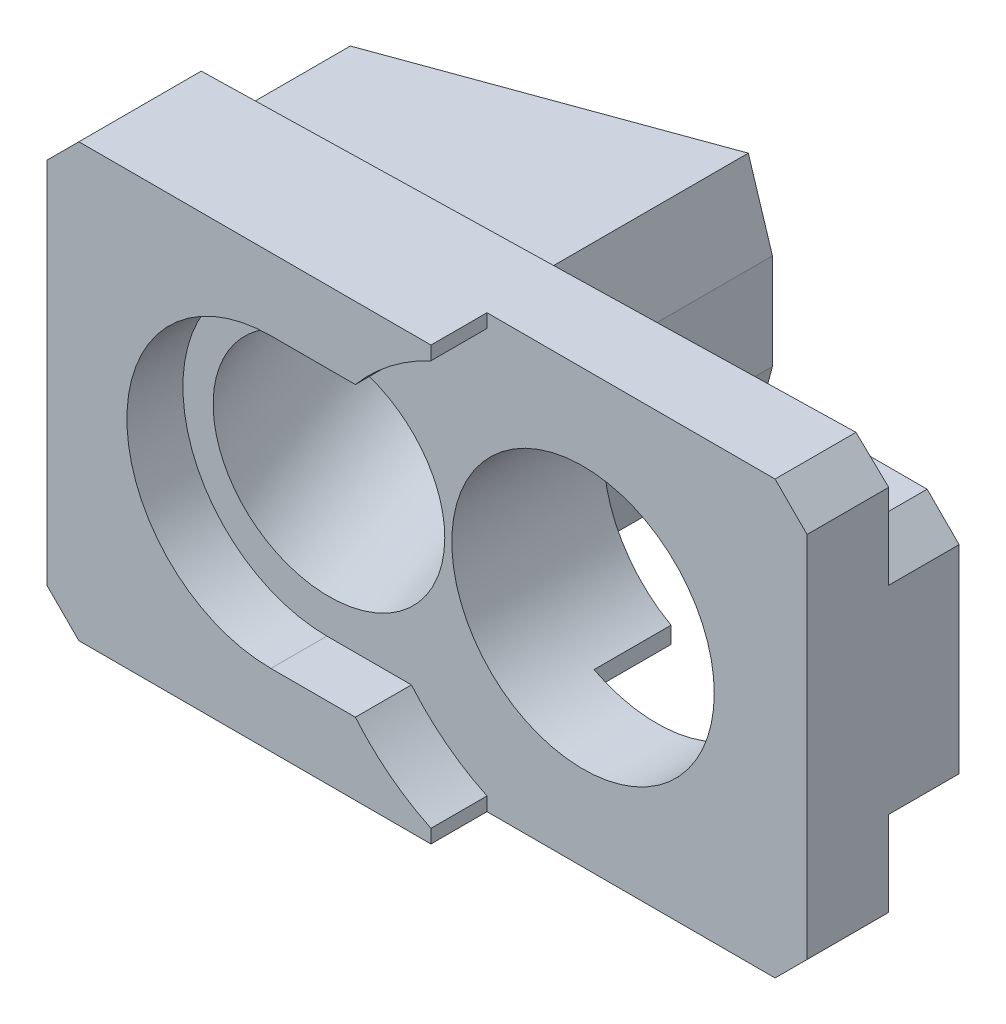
ISO-10303-21;
HEADER;
FILE_DESCRIPTION(('STEP AP214'),'2;1');
FILE_NAME('part.step','',(''),(''),'','','');
FILE_SCHEMA(('AUTOMOTIVE_DESIGN { 1 0 10303 214 1 1 1 1 }'));
ENDSEC;
DATA;
#1=APPLICATION_CONTEXT('core data for automotive mechanical design processes');
#2=APPLICATION_PROTOCOL_DEFINITION('international standard','automotive_design',2000,#1);
#3=PRODUCT_CONTEXT('',#1,'mechanical');
#4=PRODUCT('Part','Part','',(#3));
#5=PRODUCT_RELATED_PRODUCT_CATEGORY('part','',(#4));
#6=PRODUCT_DEFINITION_FORMATION('','',#4);
#7=PRODUCT_DEFINITION_CONTEXT('part definition',#1,'design');
#8=PRODUCT_DEFINITION('design','',#6,#7);
#9=PRODUCT_DEFINITION_SHAPE('','',#8);
#10=(LENGTH_UNIT() NAMED_UNIT(*) SI_UNIT(.MILLI.,.METRE.));
#11=(NAMED_UNIT(*) PLANE_ANGLE_UNIT() SI_UNIT($,.RADIAN.));
#12=(NAMED_UNIT(*) SI_UNIT($,.STERADIAN.) SOLID_ANGLE_UNIT());
#13=UNCERTAINTY_MEASURE_WITH_UNIT(LENGTH_MEASURE(1.E-05),#10,'distance_accuracy_value','');
#14=(GEOMETRIC_REPRESENTATION_CONTEXT(3) GLOBAL_UNCERTAINTY_ASSIGNED_CONTEXT((#13)) GLOBAL_UNIT_ASSIGNED_CONTEXT((#10,
#11,#12)) REPRESENTATION_CONTEXT('',''));
#15=CARTESIAN_POINT('',(0.,0.,0.));
#16=DIRECTION('',(0.,0.,1.));
#17=DIRECTION('',(1.,0.,0.));
#18=AXIS2_PLACEMENT_3D('',#15,#16,#17);
#19=CARTESIAN_POINT('',(2.,-4.1,4.75));
#20=DIRECTION('',(0.,-1.,0.));
#21=DIRECTION('',(0.,0.,-1.));
#22=AXIS2_PLACEMENT_3D('',#19,#20,#21);
#23=PLANE('',#22);
#24=DIRECTION('',(-1.,0.,0.));
#25=VECTOR('',#24,1.);
#26=CARTESIAN_POINT('',(4.36748497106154,-4.1,0.));
#27=LINE('',#26,#25);
#28=CARTESIAN_POINT('',(6.,-4.1,0.));
#29=VERTEX_POINT('',#28);
#30=CARTESIAN_POINT('',(2.,-4.1,0.));
#31=VERTEX_POINT('',#30);
#32=EDGE_CURVE('E298',#29,#31,#27,.T.);
#33=ORIENTED_EDGE('',*,*,#32,.F.);
#34=DIRECTION('',(0.,0.,1.));
#35=VECTOR('',#34,1.);
#36=CARTESIAN_POINT('',(6.,-4.1,4.75));
#37=LINE('',#36,#35);
#38=CARTESIAN_POINT('',(6.,-4.1,2.22272727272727));
#39=VERTEX_POINT('',#38);
#40=EDGE_CURVE('E252',#39,#29,#37,.F.);
#41=ORIENTED_EDGE('',*,*,#40,.F.);
#42=DIRECTION('',(0.999741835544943,0.,-0.022721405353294));
#43=VECTOR('',#42,1.);
#44=CARTESIAN_POINT('',(7.,-4.1,2.2));
#45=LINE('',#44,#43);
#46=CARTESIAN_POINT('',(2.,-4.1,2.31363636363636));
#47=VERTEX_POINT('',#46);
#48=EDGE_CURVE('E295',#39,#47,#45,.F.);
#49=ORIENTED_EDGE('',*,*,#48,.T.);
#50=DIRECTION('',(0.,0.,1.));
#51=VECTOR('',#50,1.);
#52=CARTESIAN_POINT('',(2.,-4.1,4.75));
#53=LINE('',#52,#51);
#54=EDGE_CURVE('E291',#31,#47,#53,.T.);
#55=ORIENTED_EDGE('',*,*,#54,.F.);
#56=EDGE_LOOP('',(#33,#41,#49,#55));
#57=FACE_BOUND('',#56,.T.);
#58=ADVANCED_FACE('F16',(#57),#23,.T.);
#59=CARTESIAN_POINT('',(6.,4.1,4.75));
#60=DIRECTION('',(0.,1.,0.));
#61=DIRECTION('',(0.,0.,1.));
#62=AXIS2_PLACEMENT_3D('',#59,#60,#61);
#63=PLANE('',#62);
#64=DIRECTION('',(-1.,0.,0.));
#65=VECTOR('',#64,1.);
#66=CARTESIAN_POINT('',(4.36748497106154,4.1,0.));
#67=LINE('',#66,#65);
#68=CARTESIAN_POINT('',(2.,4.1,0.));
#69=VERTEX_POINT('',#68);
#70=CARTESIAN_POINT('',(6.,4.1,0.));
#71=VERTEX_POINT('',#70);
#72=EDGE_CURVE('E283',#69,#71,#67,.F.);
#73=ORIENTED_EDGE('',*,*,#72,.F.);
#74=DIRECTION('',(0.,0.,1.));
#75=VECTOR('',#74,1.);
#76=CARTESIAN_POINT('',(2.,4.1,4.75));
#77=LINE('',#76,#75);
#78=CARTESIAN_POINT('',(2.,4.1,2.31363636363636));
#79=VERTEX_POINT('',#78);
#80=EDGE_CURVE('E268',#79,#69,#77,.F.);
#81=ORIENTED_EDGE('',*,*,#80,.F.);
#82=DIRECTION('',(0.999741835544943,0.,-0.022721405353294));
#83=VECTOR('',#82,1.);
#84=CARTESIAN_POINT('',(7.,4.10000000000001,2.2));
#85=LINE('',#84,#83);
#86=CARTESIAN_POINT('',(6.,4.1,2.22272727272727));
#87=VERTEX_POINT('',#86);
#88=EDGE_CURVE('E275',#79,#87,#85,.T.);
#89=ORIENTED_EDGE('',*,*,#88,.T.);
#90=DIRECTION('',(0.,0.,1.));
#91=VECTOR('',#90,1.);
#92=CARTESIAN_POINT('',(6.,4.1,4.75));
#93=LINE('',#92,#91);
#94=EDGE_CURVE('E310',#71,#87,#93,.T.);
#95=ORIENTED_EDGE('',*,*,#94,.F.);
#96=EDGE_LOOP('',(#73,#81,#89,#95));
#97=FACE_BOUND('',#96,.T.);
#98=ADVANCED_FACE('F882',(#97),#63,.T.);
#99=CARTESIAN_POINT('',(-2.,4.1,4.75));
#100=DIRECTION('',(0.,1.,0.));
#101=DIRECTION('',(0.,0.,1.));
#102=AXIS2_PLACEMENT_3D('',#99,#100,#101);
#103=PLANE('',#102);
#104=DIRECTION('',(-1.,0.,0.));
#105=VECTOR('',#104,1.);
#106=CARTESIAN_POINT('',(-8.5,4.1,0.));
#107=LINE('',#106,#105);
#108=CARTESIAN_POINT('',(-5.88538576,4.1,0.));
#109=VERTEX_POINT('',#108);
#110=CARTESIAN_POINT('',(-2.,4.1,0.));
#111=VERTEX_POINT('',#110);
#112=EDGE_CURVE('E232',#109,#111,#107,.F.);
#113=ORIENTED_EDGE('',*,*,#112,.F.);
#114=DIRECTION('',(0.,0.,1.));
#115=VECTOR('',#114,1.);
#116=CARTESIAN_POINT('',(-5.88538576,4.1,0.));
#117=LINE('',#116,#115);
#118=CARTESIAN_POINT('',(-5.88538576,4.1,-6.29865684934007));
#119=VERTEX_POINT('',#118);
#120=EDGE_CURVE('E205',#119,#109,#117,.T.);
#121=ORIENTED_EDGE('',*,*,#120,.F.);
#122=DIRECTION('',(-0.939692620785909,0.,0.342020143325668));
#123=VECTOR('',#122,1.);
#124=CARTESIAN_POINT('',(-10.9703557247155,4.1,-4.44787914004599));
#125=LINE('',#124,#123);
#126=CARTESIAN_POINT('',(-15.,4.1,-2.98120856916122));
#127=VERTEX_POINT('',#126);
#128=EDGE_CURVE('E188',#127,#119,#125,.F.);
#129=ORIENTED_EDGE('',*,*,#128,.F.);
#130=DIRECTION('',(0.,0.,1.));
#131=VECTOR('',#130,1.);
#132=CARTESIAN_POINT('',(-15.,4.1,6.5));
#133=LINE('',#132,#131);
#134=CARTESIAN_POINT('',(-15.,4.1,2.7));
#135=VERTEX_POINT('',#134);
#136=EDGE_CURVE('E214',#135,#127,#133,.F.);
#137=ORIENTED_EDGE('',*,*,#136,.F.);
#138=DIRECTION('',(0.999741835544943,0.,-0.022721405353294));
#139=VECTOR('',#138,1.);
#140=CARTESIAN_POINT('',(7.,4.10000000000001,2.2));
#141=LINE('',#140,#139);
#142=CARTESIAN_POINT('',(-2.,4.1,2.40454545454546));
#143=VERTEX_POINT('',#142);
#144=EDGE_CURVE('E219',#135,#143,#141,.T.);
#145=ORIENTED_EDGE('',*,*,#144,.T.);
#146=DIRECTION('',(0.,0.,-1.));
#147=VECTOR('',#146,1.);
#148=CARTESIAN_POINT('',(-2.,4.1,4.75));
#149=LINE('',#148,#147);
#150=EDGE_CURVE('E226',#111,#143,#149,.F.);
#151=ORIENTED_EDGE('',*,*,#150,.F.);
#152=EDGE_LOOP('',(#113,#121,#129,#137,#145,#151));
#153=FACE_BOUND('',#152,.T.);
#154=ADVANCED_FACE('F880',(#153),#103,.T.);
#155=CARTESIAN_POINT('',(-5.33215817,1.49662426,0.));
#156=DIRECTION('',(0.978158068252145,0.207862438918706,0.));
#157=DIRECTION('',(-0.207862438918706,0.978158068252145,0.));
#158=AXIS2_PLACEMENT_3D('',#155,#156,#157);
#159=PLANE('',#158);
#160=DIRECTION('',(-0.207862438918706,0.978158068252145,0.));
#161=VECTOR('',#160,1.);
#162=CARTESIAN_POINT('',(-5.33215817,1.49662426,0.));
#163=LINE('',#162,#161);
#164=CARTESIAN_POINT('',(-5.33215817,1.49662426,0.));
#165=VERTEX_POINT('',#164);
#166=EDGE_CURVE('E236',#165,#109,#163,.T.);
#167=ORIENTED_EDGE('',*,*,#166,.F.);
#168=DIRECTION('',(0.,0.,-1.));
#169=VECTOR('',#168,1.);
#170=CARTESIAN_POINT('',(-5.33215817,1.49662426,0.));
#171=LINE('',#170,#169);
#172=CARTESIAN_POINT('',(-5.332179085,1.49672268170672,-6.5));
#173=VERTEX_POINT('',#172);
#174=EDGE_CURVE('E201',#173,#165,#171,.F.);
#175=ORIENTED_EDGE('',*,*,#174,.F.);
#176=DIRECTION('',(0.207270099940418,-0.9753706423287,-0.0754401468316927));
#177=VECTOR('',#176,1.);
#178=CARTESIAN_POINT('',(-5.88538576,4.1,-6.29865684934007));
#179=LINE('',#178,#177);
#180=EDGE_CURVE('E181',#119,#173,#179,.T.);
#181=ORIENTED_EDGE('',*,*,#180,.F.);
#182=ORIENTED_EDGE('',*,*,#120,.T.);
#183=EDGE_LOOP('',(#167,#175,#181,#182));
#184=FACE_BOUND('',#183,.T.);
#185=ADVANCED_FACE('F599',(#184),#159,.T.);
#186=CARTESIAN_POINT('',(-5.33215817,-1.49662426,0.));
#187=DIRECTION('',(1.,0.,0.));
#188=DIRECTION('',(0.,0.,-1.));
#189=AXIS2_PLACEMENT_3D('',#186,#187,#188);
#190=PLANE('',#189);
#191=DIRECTION('',(0.,1.,0.));
#192=VECTOR('',#191,1.);
#193=CARTESIAN_POINT('',(-5.33215817,0.,0.));
#194=LINE('',#193,#192);
#195=CARTESIAN_POINT('',(-5.33215817,-1.49662426,0.));
#196=VERTEX_POINT('',#195);
#197=EDGE_CURVE('E372',#196,#165,#194,.T.);
#198=ORIENTED_EDGE('',*,*,#197,.F.);
#199=DIRECTION('',(0.,0.,1.));
#200=VECTOR('',#199,1.);
#201=CARTESIAN_POINT('',(-5.33215817,-1.49662426,0.));
#202=LINE('',#201,#200);
#203=CARTESIAN_POINT('',(-5.332179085,-1.4967226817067,-6.5));
#204=VERTEX_POINT('',#203);
#205=EDGE_CURVE('E204',#204,#196,#202,.T.);
#206=ORIENTED_EDGE('',*,*,#205,.F.);
#207=DIRECTION('',(0.,-1.,0.));
#208=VECTOR('',#207,1.);
#209=CARTESIAN_POINT('',(-5.33215817,0.,-6.5000152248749));
#210=LINE('',#209,#208);
#211=EDGE_CURVE('E178',#173,#204,#210,.T.);
#212=ORIENTED_EDGE('',*,*,#211,.F.);
#213=ORIENTED_EDGE('',*,*,#174,.T.);
#214=EDGE_LOOP('',(#198,#206,#212,#213));
#215=FACE_BOUND('',#214,.T.);
#216=ADVANCED_FACE('F595',(#215),#190,.T.);
#217=CARTESIAN_POINT('',(-5.88538576,-4.1,0.));
#218=DIRECTION('',(0.978158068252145,-0.207862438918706,0.));
#219=DIRECTION('',(0.207862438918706,0.978158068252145,0.));
#220=AXIS2_PLACEMENT_3D('',#217,#218,#219);
#221=PLANE('',#220);
#222=DIRECTION('',(0.207862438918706,0.978158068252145,0.));
#223=VECTOR('',#222,1.);
#224=CARTESIAN_POINT('',(-5.88538576,-4.1,0.));
#225=LINE('',#224,#223);
#226=CARTESIAN_POINT('',(-5.88538576,-4.1,0.));
#227=VERTEX_POINT('',#226);
#228=EDGE_CURVE('E366',#227,#196,#225,.T.);
#229=ORIENTED_EDGE('',*,*,#228,.F.);
#230=DIRECTION('',(0.,0.,-1.));
#231=VECTOR('',#230,1.);
#232=CARTESIAN_POINT('',(-5.88538576,-4.1,4.75));
#233=LINE('',#232,#231);
#234=CARTESIAN_POINT('',(-5.88538576,-4.1,-6.29865684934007));
#235=VERTEX_POINT('',#234);
#236=EDGE_CURVE('E124',#235,#227,#233,.F.);
#237=ORIENTED_EDGE('',*,*,#236,.F.);
#238=DIRECTION('',(-0.207270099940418,-0.975370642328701,0.0754401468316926));
#239=VECTOR('',#238,1.);
#240=CARTESIAN_POINT('',(-5.3322,-1.49682110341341,-6.5));
#241=LINE('',#240,#239);
#242=EDGE_CURVE('E180',#204,#235,#241,.T.);
#243=ORIENTED_EDGE('',*,*,#242,.F.);
#244=ORIENTED_EDGE('',*,*,#205,.T.);
#245=EDGE_LOOP('',(#229,#237,#243,#244));
#246=FACE_BOUND('',#245,.T.);
#247=ADVANCED_FACE('F583',(#246),#221,.T.);
#248=CARTESIAN_POINT('',(-15.,-4.1,4.75));
#249=DIRECTION('',(0.,-1.,0.));
#250=DIRECTION('',(0.,0.,-1.));
#251=AXIS2_PLACEMENT_3D('',#248,#249,#250);
#252=PLANE('',#251);
#253=DIRECTION('',(0.999741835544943,0.,-0.022721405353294));
#254=VECTOR('',#253,1.);
#255=CARTESIAN_POINT('',(7.,-4.1,2.2));
#256=LINE('',#255,#254);
#257=CARTESIAN_POINT('',(-2.,-4.1,2.40454545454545));
#258=VERTEX_POINT('',#257);
#259=CARTESIAN_POINT('',(-15.,-4.1,2.7));
#260=VERTEX_POINT('',#259);
#261=EDGE_CURVE('E355',#258,#260,#256,.F.);
#262=ORIENTED_EDGE('',*,*,#261,.T.);
#263=DIRECTION('',(0.,0.,1.));
#264=VECTOR('',#263,1.);
#265=CARTESIAN_POINT('',(-15.,-4.1,6.5));
#266=LINE('',#265,#264);
#267=CARTESIAN_POINT('',(-15.,-4.1,-2.98120856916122));
#268=VERTEX_POINT('',#267);
#269=EDGE_CURVE('E123',#268,#260,#266,.T.);
#270=ORIENTED_EDGE('',*,*,#269,.F.);
#271=DIRECTION('',(-0.939692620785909,0.,0.342020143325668));
#272=VECTOR('',#271,1.);
#273=CARTESIAN_POINT('',(-10.9703557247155,-4.1,-4.44787914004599));
#274=LINE('',#273,#272);
#275=EDGE_CURVE('E131',#235,#268,#274,.T.);
#276=ORIENTED_EDGE('',*,*,#275,.F.);
#277=ORIENTED_EDGE('',*,*,#236,.T.);
#278=DIRECTION('',(-1.,0.,0.));
#279=VECTOR('',#278,1.);
#280=CARTESIAN_POINT('',(-8.5,-4.1,0.));
#281=LINE('',#280,#279);
#282=CARTESIAN_POINT('',(-2.,-4.1,0.));
#283=VERTEX_POINT('',#282);
#284=EDGE_CURVE('E363',#283,#227,#281,.T.);
#285=ORIENTED_EDGE('',*,*,#284,.F.);
#286=DIRECTION('',(0.,0.,-1.));
#287=VECTOR('',#286,1.);
#288=CARTESIAN_POINT('',(-2.,-4.1,4.75));
#289=LINE('',#288,#287);
#290=EDGE_CURVE('E235',#258,#283,#289,.T.);
#291=ORIENTED_EDGE('',*,*,#290,.F.);
#292=EDGE_LOOP('',(#262,#270,#276,#277,#285,#291));
#293=FACE_BOUND('',#292,.T.);
#294=ADVANCED_FACE('F658',(#293),#252,.T.);
#295=CARTESIAN_POINT('',(-15.,5.75,6.5));
#296=DIRECTION('',(-1.,0.,0.));
#297=DIRECTION('',(0.,0.,1.));
#298=AXIS2_PLACEMENT_3D('',#295,#296,#297);
#299=PLANE('',#298);
#300=ORIENTED_EDGE('',*,*,#136,.T.);
#301=DIRECTION('',(0.,1.,0.));
#302=VECTOR('',#301,1.);
#303=CARTESIAN_POINT('',(-15.,0.,-2.98120856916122));
#304=LINE('',#303,#302);
#305=CARTESIAN_POINT('',(-15.0000000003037,0.236206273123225,-2.98120857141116));
#306=VERTEX_POINT('',#305);
#307=EDGE_CURVE('E121',#306,#127,#304,.T.);
#308=ORIENTED_EDGE('',*,*,#307,.F.);
#309=CARTESIAN_POINT('',(-15.0000000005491,0.236206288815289,-2.98120857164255));
#310=CARTESIAN_POINT('',(-15.0000000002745,0.15747085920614,-2.97757772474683));
#311=CARTESIAN_POINT('',(-15.0000000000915,0.078735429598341,-2.97576230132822));
#312=CARTESIAN_POINT('',(-14.9999999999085,-0.0787354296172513,-2.97576230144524));
#313=CARTESIAN_POINT('',(-14.9999999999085,-0.157470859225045,-2.97757772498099));
#314=CARTESIAN_POINT('',(-15.,-0.236206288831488,-2.98120857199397));
#315=B_SPLINE_CURVE_WITH_KNOTS('',3,(#309,#310,#311,#312,#313,#314),.UNSPECIFIED.,.F.,.F.,(4,2,
4),(0.,0.236269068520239,0.472538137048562),.UNSPECIFIED.);
#316=CARTESIAN_POINT('',(-15.0000000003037,-0.236206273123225,-2.98120857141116));
#317=VERTEX_POINT('',#316);
#318=EDGE_CURVE('E19',#306,#317,#315,.T.);
#319=ORIENTED_EDGE('',*,*,#318,.T.);
#320=DIRECTION('',(0.,1.,0.));
#321=VECTOR('',#320,1.);
#322=CARTESIAN_POINT('',(-15.,0.,-2.98120856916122));
#323=LINE('',#322,#321);
#324=EDGE_CURVE('E119',#268,#317,#323,.T.);
#325=ORIENTED_EDGE('',*,*,#324,.F.);
#326=ORIENTED_EDGE('',*,*,#269,.T.);
#327=DIRECTION('',(0.,1.,0.));
#328=VECTOR('',#327,1.);
#329=CARTESIAN_POINT('',(-15.,-6.75,2.7));
#330=LINE('',#329,#328);
#331=CARTESIAN_POINT('',(-15.,-5.75,2.7));
#332=VERTEX_POINT('',#331);
#333=EDGE_CURVE('E359',#260,#332,#330,.F.);
#334=ORIENTED_EDGE('',*,*,#333,.T.);
#335=DIRECTION('',(0.,0.,1.));
#336=VECTOR('',#335,1.);
#337=CARTESIAN_POINT('',(-15.,-5.75,6.5));
#338=LINE('',#337,#336);
#339=CARTESIAN_POINT('',(-15.,-5.75,6.5));
#340=VERTEX_POINT('',#339);
#341=EDGE_CURVE('E557',#340,#332,#338,.F.);
#342=ORIENTED_EDGE('',*,*,#341,.F.);
#343=DIRECTION('',(0.,1.,0.));
#344=VECTOR('',#343,1.);
#345=CARTESIAN_POINT('',(-15.,0.,6.5));
#346=LINE('',#345,#344);
#347=CARTESIAN_POINT('',(-15.,5.75,6.5));
#348=VERTEX_POINT('',#347);
#349=EDGE_CURVE('E421',#340,#348,#346,.T.);
#350=ORIENTED_EDGE('',*,*,#349,.T.);
#351=DIRECTION('',(0.,0.,1.));
#352=VECTOR('',#351,1.);
#353=CARTESIAN_POINT('',(-15.,5.75,6.5));
#354=LINE('',#353,#352);
#355=CARTESIAN_POINT('',(-15.,5.75000000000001,2.7));
#356=VERTEX_POINT('',#355);
#357=EDGE_CURVE('E249',#356,#348,#354,.T.);
#358=ORIENTED_EDGE('',*,*,#357,.F.);
#359=DIRECTION('',(0.,1.,0.));
#360=VECTOR('',#359,1.);
#361=CARTESIAN_POINT('',(-15.,-6.75,2.7));
#362=LINE('',#361,#360);
#363=EDGE_CURVE('E223',#356,#135,#362,.F.);
#364=ORIENTED_EDGE('',*,*,#363,.T.);
#365=EDGE_LOOP('',(#300,#308,#319,#325,#326,#334,#342,#350,#358,#364));
#366=FACE_BOUND('',#365,.T.);
#367=ADVANCED_FACE('F117',(#366),#299,.T.);
#368=CARTESIAN_POINT('',(-3.,0.,5.625));
#369=DIRECTION('',(1.,0.,0.));
#370=DIRECTION('',(0.,0.,-1.));
#371=AXIS2_PLACEMENT_3D('',#368,#369,#370);
#372=PLANE('',#371);
#373=DIRECTION('',(0.,0.,1.));
#374=VECTOR('',#373,1.);
#375=CARTESIAN_POINT('',(-3.,6.75,6.5));
#376=LINE('',#375,#374);
#377=CARTESIAN_POINT('',(-3.,6.75,6.5));
#378=VERTEX_POINT('',#377);
#379=CARTESIAN_POINT('',(-3.,6.75,4.75));
#380=VERTEX_POINT('',#379);
#381=EDGE_CURVE('E388',#378,#380,#376,.F.);
#382=ORIENTED_EDGE('',*,*,#381,.F.);
#383=DIRECTION('',(0.,1.,0.));
#384=VECTOR('',#383,1.);
#385=CARTESIAN_POINT('',(-3.,0.,6.5));
#386=LINE('',#385,#384);
#387=CARTESIAN_POINT('',(-3.,6.32455532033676,6.5));
#388=VERTEX_POINT('',#387);
#389=EDGE_CURVE('E367',#378,#388,#386,.F.);
#390=ORIENTED_EDGE('',*,*,#389,.T.);
#391=DIRECTION('',(0.,0.,1.));
#392=VECTOR('',#391,1.);
#393=CARTESIAN_POINT('',(-3.,6.32455532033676,5.625));
#394=LINE('',#393,#392);
#395=CARTESIAN_POINT('',(-3.,6.32455532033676,4.75));
#396=VERTEX_POINT('',#395);
#397=EDGE_CURVE('E173',#388,#396,#394,.F.);
#398=ORIENTED_EDGE('',*,*,#397,.T.);
#399=DIRECTION('',(0.,1.,0.));
#400=VECTOR('',#399,1.);
#401=CARTESIAN_POINT('',(-3.,0.,4.75));
#402=LINE('',#401,#400);
#403=EDGE_CURVE('E216',#396,#380,#402,.T.);
#404=ORIENTED_EDGE('',*,*,#403,.T.);
#405=EDGE_LOOP('',(#382,#390,#398,#404));
#406=FACE_BOUND('',#405,.T.);
#407=ADVANCED_FACE('F775',(#406),#372,.T.);
#408=CARTESIAN_POINT('',(-14.,6.75,6.5));
#409=DIRECTION('',(-0.707106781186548,0.707106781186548,0.));
#410=DIRECTION('',(-0.707106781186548,-0.707106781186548,0.));
#411=AXIS2_PLACEMENT_3D('',#408,#409,#410);
#412=PLANE('',#411);
#413=DIRECTION('',(0.707106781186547,0.707106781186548,0.));
#414=VECTOR('',#413,1.);
#415=CARTESIAN_POINT('',(-15.,5.75,6.5));
#416=LINE('',#415,#414);
#417=CARTESIAN_POINT('',(-14.,6.75,6.5));
#418=VERTEX_POINT('',#417);
#419=EDGE_CURVE('E418',#348,#418,#416,.T.);
#420=ORIENTED_EDGE('',*,*,#419,.T.);
#421=DIRECTION('',(0.,0.,1.));
#422=VECTOR('',#421,1.);
#423=CARTESIAN_POINT('',(-14.,6.75,6.5));
#424=LINE('',#423,#422);
#425=CARTESIAN_POINT('',(-14.,6.75,2.67727272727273));
#426=VERTEX_POINT('',#425);
#427=EDGE_CURVE('E259',#426,#418,#424,.T.);
#428=ORIENTED_EDGE('',*,*,#427,.F.);
#429=DIRECTION('',(-0.707015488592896,-0.707015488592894,0.0160685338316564));
#430=VECTOR('',#429,1.);
#431=CARTESIAN_POINT('',(-14.,6.75000000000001,2.67727272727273));
#432=LINE('',#431,#430);
#433=EDGE_CURVE('E241',#426,#356,#432,.T.);
#434=ORIENTED_EDGE('',*,*,#433,.T.);
#435=ORIENTED_EDGE('',*,*,#357,.T.);
#436=EDGE_LOOP('',(#420,#428,#434,#435));
#437=FACE_BOUND('',#436,.T.);
#438=ADVANCED_FACE('F770',(#437),#412,.T.);
#439=CARTESIAN_POINT('',(6.,-4.1,4.75));
#440=DIRECTION('',(0.707106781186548,-0.707106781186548,0.));
#441=DIRECTION('',(0.707106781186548,0.707106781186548,0.));
#442=AXIS2_PLACEMENT_3D('',#439,#440,#441);
#443=PLANE('',#442);
#444=DIRECTION('',(-0.707106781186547,-0.707106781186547,0.));
#445=VECTOR('',#444,1.);
#446=CARTESIAN_POINT('',(7.,-3.1,0.));
#447=LINE('',#446,#445);
#448=CARTESIAN_POINT('',(7.,-3.1,0.));
#449=VERTEX_POINT('',#448);
#450=EDGE_CURVE('E301',#449,#29,#447,.T.);
#451=ORIENTED_EDGE('',*,*,#450,.F.);
#452=DIRECTION('',(0.,0.,-1.));
#453=VECTOR('',#452,1.);
#454=CARTESIAN_POINT('',(7.,-3.1,6.5));
#455=LINE('',#454,#453);
#456=CARTESIAN_POINT('',(7.,-3.1,2.2));
#457=VERTEX_POINT('',#456);
#458=EDGE_CURVE('E313',#457,#449,#455,.T.);
#459=ORIENTED_EDGE('',*,*,#458,.F.);
#460=DIRECTION('',(-0.707015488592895,-0.707015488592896,0.0160685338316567));
#461=VECTOR('',#460,1.);
#462=CARTESIAN_POINT('',(7.,-3.1,2.2));
#463=LINE('',#462,#461);
#464=EDGE_CURVE('E337',#457,#39,#463,.T.);
#465=ORIENTED_EDGE('',*,*,#464,.T.);
#466=ORIENTED_EDGE('',*,*,#40,.T.);
#467=EDGE_LOOP('',(#451,#459,#465,#466));
#468=FACE_BOUND('',#467,.T.);
#469=ADVANCED_FACE('F716',(#468),#443,.T.);
#470=CARTESIAN_POINT('',(7.,3.1,4.75));
#471=DIRECTION('',(0.707106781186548,0.707106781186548,0.));
#472=DIRECTION('',(-0.707106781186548,0.707106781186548,0.));
#473=AXIS2_PLACEMENT_3D('',#470,#471,#472);
#474=PLANE('',#473);
#475=DIRECTION('',(0.707106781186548,-0.707106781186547,0.));
#476=VECTOR('',#475,1.);
#477=CARTESIAN_POINT('',(6.,4.1,0.));
#478=LINE('',#477,#476);
#479=CARTESIAN_POINT('',(7.,3.1,0.));
#480=VERTEX_POINT('',#479);
#481=EDGE_CURVE('E287',#71,#480,#478,.T.);
#482=ORIENTED_EDGE('',*,*,#481,.F.);
#483=ORIENTED_EDGE('',*,*,#94,.T.);
#484=DIRECTION('',(0.707015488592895,-0.707015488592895,-0.0160685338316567));
#485=VECTOR('',#484,1.);
#486=CARTESIAN_POINT('',(6.,4.10000000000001,2.22272727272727));
#487=LINE('',#486,#485);
#488=CARTESIAN_POINT('',(7.,3.1,2.2));
#489=VERTEX_POINT('',#488);
#490=EDGE_CURVE('E279',#87,#489,#487,.T.);
#491=ORIENTED_EDGE('',*,*,#490,.T.);
#492=DIRECTION('',(0.,0.,-1.));
#493=VECTOR('',#492,1.);
#494=CARTESIAN_POINT('',(7.,3.1,6.5));
#495=LINE('',#494,#493);
#496=EDGE_CURVE('E322',#480,#489,#495,.F.);
#497=ORIENTED_EDGE('',*,*,#496,.F.);
#498=EDGE_LOOP('',(#482,#483,#491,#497));
#499=FACE_BOUND('',#498,.T.);
#500=ADVANCED_FACE('F724',(#499),#474,.T.);
#501=CARTESIAN_POINT('',(7.,5.75,6.5));
#502=DIRECTION('',(0.707106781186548,0.707106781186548,0.));
#503=DIRECTION('',(-0.707106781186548,0.707106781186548,0.));
#504=AXIS2_PLACEMENT_3D('',#501,#502,#503);
#505=PLANE('',#504);
#506=DIRECTION('',(-0.707015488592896,0.707015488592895,0.0160685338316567));
#507=VECTOR('',#506,1.);
#508=CARTESIAN_POINT('',(7.,5.75000000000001,2.2));
#509=LINE('',#508,#507);
#510=CARTESIAN_POINT('',(7.,5.75000000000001,2.2));
#511=VERTEX_POINT('',#510);
#512=CARTESIAN_POINT('',(6.,6.75,2.22272727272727));
#513=VERTEX_POINT('',#512);
#514=EDGE_CURVE('E246',#511,#513,#509,.T.);
#515=ORIENTED_EDGE('',*,*,#514,.T.);
#516=DIRECTION('',(0.,0.,1.));
#517=VECTOR('',#516,1.);
#518=CARTESIAN_POINT('',(6.,6.75,6.5));
#519=LINE('',#518,#517);
#520=CARTESIAN_POINT('',(6.,6.75,4.75));
#521=VERTEX_POINT('',#520);
#522=EDGE_CURVE('E260',#521,#513,#519,.F.);
#523=ORIENTED_EDGE('',*,*,#522,.F.);
#524=DIRECTION('',(-0.707106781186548,0.707106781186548,0.));
#525=VECTOR('',#524,1.);
#526=CARTESIAN_POINT('',(7.,5.75,4.75));
#527=LINE('',#526,#525);
#528=CARTESIAN_POINT('',(7.,5.75,4.75));
#529=VERTEX_POINT('',#528);
#530=EDGE_CURVE('E327',#521,#529,#527,.F.);
#531=ORIENTED_EDGE('',*,*,#530,.T.);
#532=DIRECTION('',(0.,0.,-1.));
#533=VECTOR('',#532,1.);
#534=CARTESIAN_POINT('',(7.,5.75,6.5));
#535=LINE('',#534,#533);
#536=EDGE_CURVE('E399',#511,#529,#535,.F.);
#537=ORIENTED_EDGE('',*,*,#536,.F.);
#538=EDGE_LOOP('',(#515,#523,#531,#537));
#539=FACE_BOUND('',#538,.T.);
#540=ADVANCED_FACE('F737',(#539),#505,.T.);
#541=CARTESIAN_POINT('',(-15.,-5.75,6.5));
#542=DIRECTION('',(-0.707106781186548,-0.707106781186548,0.));
#543=DIRECTION('',(0.707106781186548,-0.707106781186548,0.));
#544=AXIS2_PLACEMENT_3D('',#541,#542,#543);
#545=PLANE('',#544);
#546=DIRECTION('',(-0.707106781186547,0.707106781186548,0.));
#547=VECTOR('',#546,1.);
#548=CARTESIAN_POINT('',(-14.,-6.75,6.5));
#549=LINE('',#548,#547);
#550=CARTESIAN_POINT('',(-14.,-6.75,6.5));
#551=VERTEX_POINT('',#550);
#552=EDGE_CURVE('E426',#551,#340,#549,.T.);
#553=ORIENTED_EDGE('',*,*,#552,.T.);
#554=ORIENTED_EDGE('',*,*,#341,.T.);
#555=DIRECTION('',(0.707015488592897,-0.707015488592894,-0.0160685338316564));
#556=VECTOR('',#555,1.);
#557=CARTESIAN_POINT('',(-15.,-5.75,2.7));
#558=LINE('',#557,#556);
#559=CARTESIAN_POINT('',(-14.,-6.75,2.67727272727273));
#560=VERTEX_POINT('',#559);
#561=EDGE_CURVE('E438',#332,#560,#558,.T.);
#562=ORIENTED_EDGE('',*,*,#561,.T.);
#563=DIRECTION('',(0.,0.,-1.));
#564=VECTOR('',#563,1.);
#565=CARTESIAN_POINT('',(-14.,-6.75,6.5));
#566=LINE('',#565,#564);
#567=EDGE_CURVE('E404',#551,#560,#566,.T.);
#568=ORIENTED_EDGE('',*,*,#567,.F.);
#569=EDGE_LOOP('',(#553,#554,#562,#568));
#570=FACE_BOUND('',#569,.T.);
#571=ADVANCED_FACE('F672',(#570),#545,.T.);
#572=CARTESIAN_POINT('',(6.,-6.75,6.5));
#573=DIRECTION('',(0.707106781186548,-0.707106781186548,0.));
#574=DIRECTION('',(0.707106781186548,0.707106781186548,0.));
#575=AXIS2_PLACEMENT_3D('',#572,#573,#574);
#576=PLANE('',#575);
#577=DIRECTION('',(0.707015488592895,0.707015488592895,-0.0160685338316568));
#578=VECTOR('',#577,1.);
#579=CARTESIAN_POINT('',(6.,-6.75,2.22272727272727));
#580=LINE('',#579,#578);
#581=CARTESIAN_POINT('',(6.,-6.75,2.22272727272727));
#582=VERTEX_POINT('',#581);
#583=CARTESIAN_POINT('',(7.,-5.75,2.2));
#584=VERTEX_POINT('',#583);
#585=EDGE_CURVE('E342',#582,#584,#580,.T.);
#586=ORIENTED_EDGE('',*,*,#585,.T.);
#587=DIRECTION('',(0.,0.,-1.));
#588=VECTOR('',#587,1.);
#589=CARTESIAN_POINT('',(7.,-5.75,6.5));
#590=LINE('',#589,#588);
#591=CARTESIAN_POINT('',(7.,-5.75,4.75));
#592=VERTEX_POINT('',#591);
#593=EDGE_CURVE('E347',#592,#584,#590,.T.);
#594=ORIENTED_EDGE('',*,*,#593,.F.);
#595=DIRECTION('',(0.707106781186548,0.707106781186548,0.));
#596=VECTOR('',#595,1.);
#597=CARTESIAN_POINT('',(6.,-6.75,4.75));
#598=LINE('',#597,#596);
#599=CARTESIAN_POINT('',(6.,-6.75,4.75));
#600=VERTEX_POINT('',#599);
#601=EDGE_CURVE('E552',#592,#600,#598,.F.);
#602=ORIENTED_EDGE('',*,*,#601,.T.);
#603=DIRECTION('',(0.,0.,-1.));
#604=VECTOR('',#603,1.);
#605=CARTESIAN_POINT('',(6.,-6.75,6.5));
#606=LINE('',#605,#604);
#607=EDGE_CURVE('E465',#582,#600,#606,.F.);
#608=ORIENTED_EDGE('',*,*,#607,.F.);
#609=EDGE_LOOP('',(#586,#594,#602,#608));
#610=FACE_BOUND('',#609,.T.);
#611=ADVANCED_FACE('F751',(#610),#576,.T.);
#612=CARTESIAN_POINT('',(-3.,0.,5.625));
#613=DIRECTION('',(1.,0.,0.));
#614=DIRECTION('',(0.,0.,-1.));
#615=AXIS2_PLACEMENT_3D('',#612,#613,#614);
#616=PLANE('',#615);
#617=DIRECTION('',(0.,0.,-1.));
#618=VECTOR('',#617,1.);
#619=CARTESIAN_POINT('',(-3.,-6.75,6.5));
#620=LINE('',#619,#618);
#621=CARTESIAN_POINT('',(-3.,-6.75,4.75));
#622=VERTEX_POINT('',#621);
#623=CARTESIAN_POINT('',(-3.,-6.75,6.5));
#624=VERTEX_POINT('',#623);
#625=EDGE_CURVE('E395',#622,#624,#620,.F.);
#626=ORIENTED_EDGE('',*,*,#625,.F.);
#627=DIRECTION('',(0.,1.,0.));
#628=VECTOR('',#627,1.);
#629=CARTESIAN_POINT('',(-3.,0.,4.75));
#630=LINE('',#629,#628);
#631=CARTESIAN_POINT('',(-3.,-6.32455532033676,4.75));
#632=VERTEX_POINT('',#631);
#633=EDGE_CURVE('E547',#622,#632,#630,.T.);
#634=ORIENTED_EDGE('',*,*,#633,.T.);
#635=DIRECTION('',(0.,0.,1.));
#636=VECTOR('',#635,1.);
#637=CARTESIAN_POINT('',(-3.00000000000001,-6.32455532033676,5.625));
#638=LINE('',#637,#636);
#639=CARTESIAN_POINT('',(-3.,-6.32455532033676,6.5));
#640=VERTEX_POINT('',#639);
#641=EDGE_CURVE('E168',#632,#640,#638,.T.);
#642=ORIENTED_EDGE('',*,*,#641,.T.);
#643=DIRECTION('',(0.,1.,0.));
#644=VECTOR('',#643,1.);
#645=CARTESIAN_POINT('',(-3.,0.,6.5));
#646=LINE('',#645,#644);
#647=EDGE_CURVE('E544',#640,#624,#646,.F.);
#648=ORIENTED_EDGE('',*,*,#647,.T.);
#649=EDGE_LOOP('',(#626,#634,#642,#648));
#650=FACE_BOUND('',#649,.T.);
#651=ADVANCED_FACE('F757',(#650),#616,.T.);
#652=CARTESIAN_POINT('',(-4.,0.,6.5));
#653=DIRECTION('',(0.,0.,-1.));
#654=DIRECTION('',(-1.,0.,0.));
#655=AXIS2_PLACEMENT_3D('',#652,#653,#654);
#656=PLANE('',#655);
#657=DIRECTION('',(1.,0.,0.));
#658=VECTOR('',#657,1.);
#659=CARTESIAN_POINT('',(-4.,4.5,6.5));
#660=LINE('',#659,#658);
#661=CARTESIAN_POINT('',(-5.36190264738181,4.5,6.5));
#662=VERTEX_POINT('',#661);
#663=CARTESIAN_POINT('',(-8.,4.5,6.5));
#664=VERTEX_POINT('',#663);
#665=EDGE_CURVE('E177',#662,#664,#660,.F.);
#666=ORIENTED_EDGE('',*,*,#665,.F.);
#667=CARTESIAN_POINT('',(0.,0.,6.5));
#668=DIRECTION('',(0.,0.,1.));
#669=DIRECTION('',(1.,0.,0.));
#670=AXIS2_PLACEMENT_3D('',#667,#668,#669);
#671=CIRCLE('',#670,7.);
#672=EDGE_CURVE('E169',#662,#388,#671,.F.);
#673=ORIENTED_EDGE('',*,*,#672,.T.);
#674=ORIENTED_EDGE('',*,*,#389,.F.);
#675=DIRECTION('',(1.,0.,0.));
#676=VECTOR('',#675,1.);
#677=CARTESIAN_POINT('',(6.,6.75,6.5));
#678=LINE('',#677,#676);
#679=EDGE_CURVE('E265',#418,#378,#678,.T.);
#680=ORIENTED_EDGE('',*,*,#679,.F.);
#681=ORIENTED_EDGE('',*,*,#419,.F.);
#682=ORIENTED_EDGE('',*,*,#349,.F.);
#683=ORIENTED_EDGE('',*,*,#552,.F.);
#684=DIRECTION('',(1.,0.,0.));
#685=VECTOR('',#684,1.);
#686=CARTESIAN_POINT('',(-14.,-6.75,6.5));
#687=LINE('',#686,#685);
#688=EDGE_CURVE('E398',#624,#551,#687,.F.);
#689=ORIENTED_EDGE('',*,*,#688,.F.);
#690=ORIENTED_EDGE('',*,*,#647,.F.);
#691=CARTESIAN_POINT('',(0.,0.,6.5));
#692=DIRECTION('',(0.,0.,1.));
#693=DIRECTION('',(1.,0.,0.));
#694=AXIS2_PLACEMENT_3D('',#691,#692,#693);
#695=CIRCLE('',#694,7.);
#696=CARTESIAN_POINT('',(-5.36190264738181,-4.5,6.5));
#697=VERTEX_POINT('',#696);
#698=EDGE_CURVE('E166',#640,#697,#695,.F.);
#699=ORIENTED_EDGE('',*,*,#698,.T.);
#700=DIRECTION('',(1.,0.,0.));
#701=VECTOR('',#700,1.);
#702=CARTESIAN_POINT('',(-4.,-4.5,6.5));
#703=LINE('',#702,#701);
#704=CARTESIAN_POINT('',(-8.,-4.5,6.5));
#705=VERTEX_POINT('',#704);
#706=EDGE_CURVE('E165',#705,#697,#703,.T.);
#707=ORIENTED_EDGE('',*,*,#706,.F.);
#708=CARTESIAN_POINT('',(-8.,0.,6.5));
#709=DIRECTION('',(0.,0.,1.));
#710=DIRECTION('',(1.,0.,0.));
#711=AXIS2_PLACEMENT_3D('',#708,#709,#710);
#712=CIRCLE('',#711,4.5);
#713=EDGE_CURVE('E133',#705,#664,#712,.F.);
#714=ORIENTED_EDGE('',*,*,#713,.T.);
#715=EDGE_LOOP('',(#666,#673,#674,#680,#681,#682,#683,#689,#690,#699,#707,#714));
#716=FACE_BOUND('',#715,.T.);
#717=ADVANCED_FACE('F761',(#716),#656,.F.);
#718=CARTESIAN_POINT('',(-8.5,0.,0.));
#719=DIRECTION('',(0.,0.,-1.));
#720=DIRECTION('',(-1.,0.,0.));
#721=AXIS2_PLACEMENT_3D('',#718,#719,#720);
#722=PLANE('',#721);
#723=ORIENTED_EDGE('',*,*,#112,.T.);
#724=DIRECTION('',(0.,1.,0.));
#725=VECTOR('',#724,1.);
#726=CARTESIAN_POINT('',(-2.,-4.1,0.));
#727=LINE('',#726,#725);
#728=CARTESIAN_POINT('',(-2.,3.57910603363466,0.));
#729=VERTEX_POINT('',#728);
#730=EDGE_CURVE('E222',#729,#111,#727,.T.);
#731=ORIENTED_EDGE('',*,*,#730,.F.);
#732=CARTESIAN_POINT('',(0.,0.,0.));
#733=DIRECTION('',(0.,0.,1.));
#734=DIRECTION('',(1.,0.,0.));
#735=AXIS2_PLACEMENT_3D('',#732,#733,#734);
#736=CIRCLE('',#735,4.1);
#737=CARTESIAN_POINT('',(-2.,-3.57910603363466,0.));
#738=VERTEX_POINT('',#737);
#739=EDGE_CURVE('E162',#729,#738,#736,.T.);
#740=ORIENTED_EDGE('',*,*,#739,.T.);
#741=DIRECTION('',(0.,1.,0.));
#742=VECTOR('',#741,1.);
#743=CARTESIAN_POINT('',(-2.,-4.1,0.));
#744=LINE('',#743,#742);
#745=EDGE_CURVE('E352',#283,#738,#744,.T.);
#746=ORIENTED_EDGE('',*,*,#745,.F.);
#747=ORIENTED_EDGE('',*,*,#284,.T.);
#748=ORIENTED_EDGE('',*,*,#228,.T.);
#749=ORIENTED_EDGE('',*,*,#197,.T.);
#750=ORIENTED_EDGE('',*,*,#166,.T.);
#751=EDGE_LOOP('',(#723,#731,#740,#746,#747,#748,#749,#750));
#752=FACE_BOUND('',#751,.T.);
#753=ADVANCED_FACE('F591',(#752),#722,.T.);
#754=CARTESIAN_POINT('',(-2.,-4.1,4.75));
#755=DIRECTION('',(1.,0.,0.));
#756=DIRECTION('',(0.,0.,-1.));
#757=AXIS2_PLACEMENT_3D('',#754,#755,#756);
#758=PLANE('',#757);
#759=ORIENTED_EDGE('',*,*,#290,.T.);
#760=ORIENTED_EDGE('',*,*,#745,.T.);
#761=DIRECTION('',(0.,0.,1.));
#762=VECTOR('',#761,1.);
#763=CARTESIAN_POINT('',(-2.,-3.57910603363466,3.25));
#764=LINE('',#763,#762);
#765=CARTESIAN_POINT('',(-2.,-3.57910603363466,2.40454545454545));
#766=VERTEX_POINT('',#765);
#767=EDGE_CURVE('E161',#738,#766,#764,.T.);
#768=ORIENTED_EDGE('',*,*,#767,.T.);
#769=DIRECTION('',(0.,1.,0.));
#770=VECTOR('',#769,1.);
#771=CARTESIAN_POINT('',(-2.,-6.75,2.40454545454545));
#772=LINE('',#771,#770);
#773=EDGE_CURVE('E360',#766,#258,#772,.F.);
#774=ORIENTED_EDGE('',*,*,#773,.T.);
#775=EDGE_LOOP('',(#759,#760,#768,#774));
#776=FACE_BOUND('',#775,.T.);
#777=ADVANCED_FACE('F847',(#776),#758,.T.);
#778=CARTESIAN_POINT('',(7.,-6.75,2.2));
#779=DIRECTION('',(0.022721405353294,0.,0.999741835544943));
#780=DIRECTION('',(0.999741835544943,0.,-0.022721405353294));
#781=AXIS2_PLACEMENT_3D('',#778,#779,#780);
#782=PLANE('',#781);
#783=DIRECTION('',(0.,1.,0.));
#784=VECTOR('',#783,1.);
#785=CARTESIAN_POINT('',(2.,4.1,2.31363636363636));
#786=LINE('',#785,#784);
#787=CARTESIAN_POINT('',(2.,-3.57910603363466,2.31363636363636));
#788=VERTEX_POINT('',#787);
#789=EDGE_CURVE('E288',#47,#788,#786,.T.);
#790=ORIENTED_EDGE('',*,*,#789,.F.);
#791=ORIENTED_EDGE('',*,*,#48,.F.);
#792=ORIENTED_EDGE('',*,*,#464,.F.);
#793=DIRECTION('',(0.,1.,0.));
#794=VECTOR('',#793,1.);
#795=CARTESIAN_POINT('',(7.,-5.75,2.2));
#796=LINE('',#795,#794);
#797=EDGE_CURVE('E317',#584,#457,#796,.T.);
#798=ORIENTED_EDGE('',*,*,#797,.F.);
#799=ORIENTED_EDGE('',*,*,#585,.F.);
#800=DIRECTION('',(0.999741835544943,0.,-0.0227214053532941));
#801=VECTOR('',#800,1.);
#802=CARTESIAN_POINT('',(-14.,-6.75,2.67727272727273));
#803=LINE('',#802,#801);
#804=EDGE_CURVE('E468',#560,#582,#803,.T.);
#805=ORIENTED_EDGE('',*,*,#804,.F.);
#806=ORIENTED_EDGE('',*,*,#561,.F.);
#807=ORIENTED_EDGE('',*,*,#333,.F.);
#808=ORIENTED_EDGE('',*,*,#261,.F.);
#809=ORIENTED_EDGE('',*,*,#773,.F.);
#810=CARTESIAN_POINT('',(0.,0.,2.35909090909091));
#811=DIRECTION('',(0.022721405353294,0.,0.999741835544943));
#812=DIRECTION('',(-0.999741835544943,0.,0.022721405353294));
#813=AXIS2_PLACEMENT_3D('',#810,#811,#812);
#814=ELLIPSE('',#813,4.10105874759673,4.1);
#815=EDGE_CURVE('E157',#766,#788,#814,.T.);
#816=ORIENTED_EDGE('',*,*,#815,.T.);
#817=EDGE_LOOP('',(#790,#791,#792,#798,#799,#805,#806,#807,#808,#809,#816));
#818=FACE_BOUND('',#817,.T.);
#819=ADVANCED_FACE('F665',(#818),#782,.F.);
#820=CARTESIAN_POINT('',(2.,4.1,4.75));
#821=DIRECTION('',(-1.,0.,0.));
#822=DIRECTION('',(0.,0.,1.));
#823=AXIS2_PLACEMENT_3D('',#820,#821,#822);
#824=PLANE('',#823);
#825=ORIENTED_EDGE('',*,*,#54,.T.);
#826=ORIENTED_EDGE('',*,*,#789,.T.);
#827=DIRECTION('',(0.,0.,1.));
#828=VECTOR('',#827,1.);
#829=CARTESIAN_POINT('',(2.,-3.57910603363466,3.25));
#830=LINE('',#829,#828);
#831=CARTESIAN_POINT('',(2.,-3.57910603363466,0.));
#832=VERTEX_POINT('',#831);
#833=EDGE_CURVE('E156',#788,#832,#830,.F.);
#834=ORIENTED_EDGE('',*,*,#833,.T.);
#835=DIRECTION('',(0.,1.,0.));
#836=VECTOR('',#835,1.);
#837=CARTESIAN_POINT('',(2.,0.,0.));
#838=LINE('',#837,#836);
#839=EDGE_CURVE('E272',#31,#832,#838,.T.);
#840=ORIENTED_EDGE('',*,*,#839,.F.);
#841=EDGE_LOOP('',(#825,#826,#834,#840));
#842=FACE_BOUND('',#841,.T.);
#843=ADVANCED_FACE('F841',(#842),#824,.T.);
#844=CARTESIAN_POINT('',(4.36748497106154,0.,0.));
#845=DIRECTION('',(0.,0.,-1.));
#846=DIRECTION('',(-1.,0.,0.));
#847=AXIS2_PLACEMENT_3D('',#844,#845,#846);
#848=PLANE('',#847);
#849=ORIENTED_EDGE('',*,*,#32,.T.);
#850=ORIENTED_EDGE('',*,*,#839,.T.);
#851=CARTESIAN_POINT('',(0.,0.,0.));
#852=DIRECTION('',(0.,0.,1.));
#853=DIRECTION('',(1.,0.,0.));
#854=AXIS2_PLACEMENT_3D('',#851,#852,#853);
#855=CIRCLE('',#854,4.1);
#856=CARTESIAN_POINT('',(2.,3.57910603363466,0.));
#857=VERTEX_POINT('',#856);
#858=EDGE_CURVE('E152',#832,#857,#855,.T.);
#859=ORIENTED_EDGE('',*,*,#858,.T.);
#860=DIRECTION('',(0.,1.,0.));
#861=VECTOR('',#860,1.);
#862=CARTESIAN_POINT('',(2.,4.1,0.));
#863=LINE('',#862,#861);
#864=EDGE_CURVE('E271',#69,#857,#863,.F.);
#865=ORIENTED_EDGE('',*,*,#864,.F.);
#866=ORIENTED_EDGE('',*,*,#72,.T.);
#867=ORIENTED_EDGE('',*,*,#481,.T.);
#868=DIRECTION('',(0.,1.,0.));
#869=VECTOR('',#868,1.);
#870=CARTESIAN_POINT('',(7.,-5.75,0.));
#871=LINE('',#870,#869);
#872=EDGE_CURVE('E316',#449,#480,#871,.T.);
#873=ORIENTED_EDGE('',*,*,#872,.F.);
#874=ORIENTED_EDGE('',*,*,#450,.T.);
#875=EDGE_LOOP('',(#849,#850,#859,#865,#866,#867,#873,#874));
#876=FACE_BOUND('',#875,.T.);
#877=ADVANCED_FACE('F720',(#876),#848,.T.);
#878=CARTESIAN_POINT('',(2.,4.1,4.75));
#879=DIRECTION('',(-1.,0.,0.));
#880=DIRECTION('',(0.,0.,1.));
#881=AXIS2_PLACEMENT_3D('',#878,#879,#880);
#882=PLANE('',#881);
#883=ORIENTED_EDGE('',*,*,#80,.T.);
#884=ORIENTED_EDGE('',*,*,#864,.T.);
#885=DIRECTION('',(0.,0.,1.));
#886=VECTOR('',#885,1.);
#887=CARTESIAN_POINT('',(2.,3.57910603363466,3.25));
#888=LINE('',#887,#886);
#889=CARTESIAN_POINT('',(2.,3.57910603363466,2.31363636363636));
#890=VERTEX_POINT('',#889);
#891=EDGE_CURVE('E151',#857,#890,#888,.T.);
#892=ORIENTED_EDGE('',*,*,#891,.T.);
#893=DIRECTION('',(0.,1.,0.));
#894=VECTOR('',#893,1.);
#895=CARTESIAN_POINT('',(2.,-6.75,2.31363636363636));
#896=LINE('',#895,#894);
#897=EDGE_CURVE('E280',#890,#79,#896,.T.);
#898=ORIENTED_EDGE('',*,*,#897,.T.);
#899=EDGE_LOOP('',(#883,#884,#892,#898));
#900=FACE_BOUND('',#899,.T.);
#901=ADVANCED_FACE('F835',(#900),#882,.T.);
#902=CARTESIAN_POINT('',(7.,-6.75,2.2));
#903=DIRECTION('',(0.022721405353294,0.,0.999741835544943));
#904=DIRECTION('',(0.999741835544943,0.,-0.022721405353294));
#905=AXIS2_PLACEMENT_3D('',#902,#903,#904);
#906=PLANE('',#905);
#907=DIRECTION('',(0.,1.,0.));
#908=VECTOR('',#907,1.);
#909=CARTESIAN_POINT('',(-2.,-4.1,2.40454545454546));
#910=LINE('',#909,#908);
#911=CARTESIAN_POINT('',(-2.,3.57910603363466,2.40454545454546));
#912=VERTEX_POINT('',#911);
#913=EDGE_CURVE('E229',#143,#912,#910,.F.);
#914=ORIENTED_EDGE('',*,*,#913,.F.);
#915=ORIENTED_EDGE('',*,*,#144,.F.);
#916=ORIENTED_EDGE('',*,*,#363,.F.);
#917=ORIENTED_EDGE('',*,*,#433,.F.);
#918=DIRECTION('',(-0.999741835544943,0.,0.0227214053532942));
#919=VECTOR('',#918,1.);
#920=CARTESIAN_POINT('',(6.,6.75,2.22272727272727));
#921=LINE('',#920,#919);
#922=EDGE_CURVE('E255',#513,#426,#921,.T.);
#923=ORIENTED_EDGE('',*,*,#922,.F.);
#924=ORIENTED_EDGE('',*,*,#514,.F.);
#925=DIRECTION('',(0.,1.,0.));
#926=VECTOR('',#925,1.);
#927=CARTESIAN_POINT('',(7.,-5.75,2.2));
#928=LINE('',#927,#926);
#929=EDGE_CURVE('E475',#489,#511,#928,.T.);
#930=ORIENTED_EDGE('',*,*,#929,.F.);
#931=ORIENTED_EDGE('',*,*,#490,.F.);
#932=ORIENTED_EDGE('',*,*,#88,.F.);
#933=ORIENTED_EDGE('',*,*,#897,.F.);
#934=CARTESIAN_POINT('',(0.,0.,2.35909090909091));
#935=DIRECTION('',(0.022721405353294,0.,0.999741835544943));
#936=DIRECTION('',(-0.999741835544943,0.,0.022721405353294));
#937=AXIS2_PLACEMENT_3D('',#934,#935,#936);
#938=ELLIPSE('',#937,4.10105874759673,4.1);
#939=EDGE_CURVE('E144',#890,#912,#938,.T.);
#940=ORIENTED_EDGE('',*,*,#939,.T.);
#941=EDGE_LOOP('',(#914,#915,#916,#917,#923,#924,#930,#931,#932,#933,#940));
#942=FACE_BOUND('',#941,.T.);
#943=ADVANCED_FACE('F731',(#942),#906,.F.);
#944=CARTESIAN_POINT('',(-2.,-4.1,4.75));
#945=DIRECTION('',(1.,0.,0.));
#946=DIRECTION('',(0.,0.,-1.));
#947=AXIS2_PLACEMENT_3D('',#944,#945,#946);
#948=PLANE('',#947);
#949=ORIENTED_EDGE('',*,*,#150,.T.);
#950=ORIENTED_EDGE('',*,*,#913,.T.);
#951=DIRECTION('',(0.,0.,1.));
#952=VECTOR('',#951,1.);
#953=CARTESIAN_POINT('',(-2.,3.57910603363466,3.25));
#954=LINE('',#953,#952);
#955=EDGE_CURVE('E137',#912,#729,#954,.F.);
#956=ORIENTED_EDGE('',*,*,#955,.T.);
#957=ORIENTED_EDGE('',*,*,#730,.T.);
#958=EDGE_LOOP('',(#949,#950,#956,#957));
#959=FACE_BOUND('',#958,.T.);
#960=ADVANCED_FACE('F829',(#959),#948,.T.);
#961=CARTESIAN_POINT('',(-10.9703557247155,0.,-4.44787914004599));
#962=DIRECTION('',(-0.342020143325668,0.,-0.939692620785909));
#963=DIRECTION('',(-0.939692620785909,0.,0.342020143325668));
#964=AXIS2_PLACEMENT_3D('',#961,#962,#963);
#965=PLANE('',#964);
#966=ORIENTED_EDGE('',*,*,#275,.T.);
#967=ORIENTED_EDGE('',*,*,#324,.T.);
#968=CARTESIAN_POINT('',(-11.2479437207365,0.,-4.3468453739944));
#969=DIRECTION('',(-0.342020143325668,0.,-0.939692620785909));
#970=DIRECTION('',(-0.939692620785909,0.,0.342020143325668));
#971=AXIS2_PLACEMENT_3D('',#968,#969,#970);
#972=CIRCLE('',#971,3.99983544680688);
#973=EDGE_CURVE('E128',#317,#306,#972,.F.);
#974=ORIENTED_EDGE('',*,*,#973,.T.);
#975=ORIENTED_EDGE('',*,*,#307,.T.);
#976=ORIENTED_EDGE('',*,*,#128,.T.);
#977=ORIENTED_EDGE('',*,*,#180,.T.);
#978=ORIENTED_EDGE('',*,*,#211,.T.);
#979=ORIENTED_EDGE('',*,*,#242,.T.);
#980=EDGE_LOOP('',(#966,#967,#974,#975,#976,#977,#978,#979));
#981=FACE_BOUND('',#980,.T.);
#982=ADVANCED_FACE('F127',(#981),#965,.T.);
#983=CARTESIAN_POINT('',(-8.,0.,5.625));
#984=DIRECTION('',(0.,0.,1.));
#985=DIRECTION('',(1.,0.,0.));
#986=AXIS2_PLACEMENT_3D('',#983,#984,#985);
#987=CYLINDRICAL_SURFACE('',#986,4.5);
#988=CARTESIAN_POINT('',(-8.,0.,4.75));
#989=DIRECTION('',(0.,0.,1.));
#990=DIRECTION('',(1.,0.,0.));
#991=AXIS2_PLACEMENT_3D('',#988,#989,#990);
#992=CIRCLE('',#991,4.5);
#993=CARTESIAN_POINT('',(-8.,-4.5,4.75));
#994=VERTEX_POINT('',#993);
#995=CARTESIAN_POINT('',(-8.,4.5,4.75));
#996=VERTEX_POINT('',#995);
#997=EDGE_CURVE('E136',#994,#996,#992,.F.);
#998=ORIENTED_EDGE('',*,*,#997,.T.);
#999=DIRECTION('',(0.,0.,-1.));
#1000=VECTOR('',#999,1.);
#1001=CARTESIAN_POINT('',(-8.,4.5,5.625));
#1002=LINE('',#1001,#1000);
#1003=EDGE_CURVE('E174',#664,#996,#1002,.T.);
#1004=ORIENTED_EDGE('',*,*,#1003,.F.);
#1005=ORIENTED_EDGE('',*,*,#713,.F.);
#1006=DIRECTION('',(0.,0.,1.));
#1007=VECTOR('',#1006,1.);
#1008=CARTESIAN_POINT('',(-8.,-4.5,5.625));
#1009=LINE('',#1008,#1007);
#1010=EDGE_CURVE('E460',#994,#705,#1009,.T.);
#1011=ORIENTED_EDGE('',*,*,#1010,.F.);
#1012=EDGE_LOOP('',(#998,#1004,#1005,#1011));
#1013=FACE_BOUND('',#1012,.T.);
#1014=ADVANCED_FACE('F779',(#1013),#987,.F.);
#1015=CARTESIAN_POINT('',(-4.,4.5,5.625));
#1016=DIRECTION('',(0.,-1.,0.));
#1017=DIRECTION('',(0.,0.,-1.));
#1018=AXIS2_PLACEMENT_3D('',#1015,#1016,#1017);
#1019=PLANE('',#1018);
#1020=ORIENTED_EDGE('',*,*,#1003,.T.);
#1021=DIRECTION('',(-1.,0.,0.));
#1022=VECTOR('',#1021,1.);
#1023=CARTESIAN_POINT('',(2.,4.5,4.75));
#1024=LINE('',#1023,#1022);
#1025=CARTESIAN_POINT('',(-5.36190264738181,4.5,4.75));
#1026=VERTEX_POINT('',#1025);
#1027=EDGE_CURVE('E141',#996,#1026,#1024,.F.);
#1028=ORIENTED_EDGE('',*,*,#1027,.T.);
#1029=DIRECTION('',(0.,0.,1.));
#1030=VECTOR('',#1029,1.);
#1031=CARTESIAN_POINT('',(-5.36190264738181,4.5,5.625));
#1032=LINE('',#1031,#1030);
#1033=EDGE_CURVE('E392',#1026,#662,#1032,.T.);
#1034=ORIENTED_EDGE('',*,*,#1033,.T.);
#1035=ORIENTED_EDGE('',*,*,#665,.T.);
#1036=EDGE_LOOP('',(#1020,#1028,#1034,#1035));
#1037=FACE_BOUND('',#1036,.T.);
#1038=ADVANCED_FACE('F822',(#1037),#1019,.T.);
#1039=CARTESIAN_POINT('',(0.,0.,5.625));
#1040=DIRECTION('',(0.,0.,1.));
#1041=DIRECTION('',(1.,0.,0.));
#1042=AXIS2_PLACEMENT_3D('',#1039,#1040,#1041);
#1043=CYLINDRICAL_SURFACE('',#1042,7.);
#1044=CARTESIAN_POINT('',(0.,0.,4.75));
#1045=DIRECTION('',(0.,0.,1.));
#1046=DIRECTION('',(1.,0.,0.));
#1047=AXIS2_PLACEMENT_3D('',#1044,#1045,#1046);
#1048=CIRCLE('',#1047,7.);
#1049=EDGE_CURVE('E433',#1026,#396,#1048,.F.);
#1050=ORIENTED_EDGE('',*,*,#1049,.T.);
#1051=ORIENTED_EDGE('',*,*,#397,.F.);
#1052=ORIENTED_EDGE('',*,*,#672,.F.);
#1053=ORIENTED_EDGE('',*,*,#1033,.F.);
#1054=EDGE_LOOP('',(#1050,#1051,#1052,#1053));
#1055=FACE_BOUND('',#1054,.T.);
#1056=ADVANCED_FACE('F819',(#1055),#1043,.F.);
#1057=CARTESIAN_POINT('',(6.,6.75,6.5));
#1058=DIRECTION('',(0.,1.,0.));
#1059=DIRECTION('',(0.,0.,1.));
#1060=AXIS2_PLACEMENT_3D('',#1057,#1058,#1059);
#1061=PLANE('',#1060);
#1062=ORIENTED_EDGE('',*,*,#427,.T.);
#1063=ORIENTED_EDGE('',*,*,#679,.T.);
#1064=ORIENTED_EDGE('',*,*,#381,.T.);
#1065=DIRECTION('',(-1.,0.,0.));
#1066=VECTOR('',#1065,1.);
#1067=CARTESIAN_POINT('',(2.,6.75,4.75));
#1068=LINE('',#1067,#1066);
#1069=EDGE_CURVE('E429',#380,#521,#1068,.F.);
#1070=ORIENTED_EDGE('',*,*,#1069,.T.);
#1071=ORIENTED_EDGE('',*,*,#522,.T.);
#1072=ORIENTED_EDGE('',*,*,#922,.T.);
#1073=EDGE_LOOP('',(#1062,#1063,#1064,#1070,#1071,#1072));
#1074=FACE_BOUND('',#1073,.T.);
#1075=ADVANCED_FACE('F772',(#1074),#1061,.T.);
#1076=CARTESIAN_POINT('',(7.,-5.75,6.5));
#1077=DIRECTION('',(1.,0.,0.));
#1078=DIRECTION('',(0.,0.,-1.));
#1079=AXIS2_PLACEMENT_3D('',#1076,#1077,#1078);
#1080=PLANE('',#1079);
#1081=ORIENTED_EDGE('',*,*,#929,.T.);
#1082=ORIENTED_EDGE('',*,*,#536,.T.);
#1083=DIRECTION('',(0.,1.,0.));
#1084=VECTOR('',#1083,1.);
#1085=CARTESIAN_POINT('',(7.,0.,4.75));
#1086=LINE('',#1085,#1084);
#1087=EDGE_CURVE('E411',#529,#592,#1086,.F.);
#1088=ORIENTED_EDGE('',*,*,#1087,.T.);
#1089=ORIENTED_EDGE('',*,*,#593,.T.);
#1090=ORIENTED_EDGE('',*,*,#797,.T.);
#1091=ORIENTED_EDGE('',*,*,#458,.T.);
#1092=ORIENTED_EDGE('',*,*,#872,.T.);
#1093=ORIENTED_EDGE('',*,*,#496,.T.);
#1094=EDGE_LOOP('',(#1081,#1082,#1088,#1089,#1090,#1091,#1092,#1093));
#1095=FACE_BOUND('',#1094,.T.);
#1096=ADVANCED_FACE('F712',(#1095),#1080,.T.);
#1097=CARTESIAN_POINT('',(-14.,-6.75,6.5));
#1098=DIRECTION('',(0.,-1.,0.));
#1099=DIRECTION('',(0.,0.,-1.));
#1100=AXIS2_PLACEMENT_3D('',#1097,#1098,#1099);
#1101=PLANE('',#1100);
#1102=ORIENTED_EDGE('',*,*,#804,.T.);
#1103=ORIENTED_EDGE('',*,*,#607,.T.);
#1104=DIRECTION('',(-1.,0.,0.));
#1105=VECTOR('',#1104,1.);
#1106=CARTESIAN_POINT('',(2.,-6.75,4.75));
#1107=LINE('',#1106,#1105);
#1108=EDGE_CURVE('E407',#600,#622,#1107,.T.);
#1109=ORIENTED_EDGE('',*,*,#1108,.T.);
#1110=ORIENTED_EDGE('',*,*,#625,.T.);
#1111=ORIENTED_EDGE('',*,*,#688,.T.);
#1112=ORIENTED_EDGE('',*,*,#567,.T.);
#1113=EDGE_LOOP('',(#1102,#1103,#1109,#1110,#1111,#1112));
#1114=FACE_BOUND('',#1113,.T.);
#1115=ADVANCED_FACE('F753',(#1114),#1101,.T.);
#1116=CARTESIAN_POINT('',(0.,0.,5.625));
#1117=DIRECTION('',(0.,0.,1.));
#1118=DIRECTION('',(1.,0.,0.));
#1119=AXIS2_PLACEMENT_3D('',#1116,#1117,#1118);
#1120=CYLINDRICAL_SURFACE('',#1119,7.);
#1121=ORIENTED_EDGE('',*,*,#698,.F.);
#1122=ORIENTED_EDGE('',*,*,#641,.F.);
#1123=CARTESIAN_POINT('',(0.,0.,4.75));
#1124=DIRECTION('',(0.,0.,1.));
#1125=DIRECTION('',(1.,0.,0.));
#1126=AXIS2_PLACEMENT_3D('',#1123,#1124,#1125);
#1127=CIRCLE('',#1126,7.);
#1128=CARTESIAN_POINT('',(-5.36190264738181,-4.5,4.75));
#1129=VERTEX_POINT('',#1128);
#1130=EDGE_CURVE('E410',#632,#1129,#1127,.F.);
#1131=ORIENTED_EDGE('',*,*,#1130,.T.);
#1132=DIRECTION('',(0.,0.,1.));
#1133=VECTOR('',#1132,1.);
#1134=CARTESIAN_POINT('',(-5.36190264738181,-4.5,5.625));
#1135=LINE('',#1134,#1133);
#1136=EDGE_CURVE('E40',#697,#1129,#1135,.F.);
#1137=ORIENTED_EDGE('',*,*,#1136,.F.);
#1138=EDGE_LOOP('',(#1121,#1122,#1131,#1137));
#1139=FACE_BOUND('',#1138,.T.);
#1140=ADVANCED_FACE('F809',(#1139),#1120,.F.);
#1141=CARTESIAN_POINT('',(-4.,-4.5,5.625));
#1142=DIRECTION('',(0.,1.,0.));
#1143=DIRECTION('',(0.,0.,1.));
#1144=AXIS2_PLACEMENT_3D('',#1141,#1142,#1143);
#1145=PLANE('',#1144);
#1146=ORIENTED_EDGE('',*,*,#1010,.T.);
#1147=ORIENTED_EDGE('',*,*,#706,.T.);
#1148=ORIENTED_EDGE('',*,*,#1136,.T.);
#1149=DIRECTION('',(-1.,0.,0.));
#1150=VECTOR('',#1149,1.);
#1151=CARTESIAN_POINT('',(2.,-4.5,4.75));
#1152=LINE('',#1151,#1150);
#1153=EDGE_CURVE('E445',#1129,#994,#1152,.T.);
#1154=ORIENTED_EDGE('',*,*,#1153,.T.);
#1155=EDGE_LOOP('',(#1146,#1147,#1148,#1154));
#1156=FACE_BOUND('',#1155,.T.);
#1157=ADVANCED_FACE('F781',(#1156),#1145,.T.);
#1158=CARTESIAN_POINT('',(0.,0.,3.25));
#1159=DIRECTION('',(0.,0.,1.));
#1160=DIRECTION('',(1.,0.,0.));
#1161=AXIS2_PLACEMENT_3D('',#1158,#1159,#1160);
#1162=CYLINDRICAL_SURFACE('',#1161,4.1);
#1163=ORIENTED_EDGE('',*,*,#939,.F.);
#1164=ORIENTED_EDGE('',*,*,#891,.F.);
#1165=ORIENTED_EDGE('',*,*,#858,.F.);
#1166=ORIENTED_EDGE('',*,*,#833,.F.);
#1167=ORIENTED_EDGE('',*,*,#815,.F.);
#1168=ORIENTED_EDGE('',*,*,#767,.F.);
#1169=ORIENTED_EDGE('',*,*,#739,.F.);
#1170=ORIENTED_EDGE('',*,*,#955,.F.);
#1171=EDGE_LOOP('',(#1163,#1164,#1165,#1166,#1167,#1168,#1169,#1170));
#1172=FACE_BOUND('',#1171,.T.);
#1173=CARTESIAN_POINT('',(0.,0.,4.75));
#1174=DIRECTION('',(0.,0.,1.));
#1175=DIRECTION('',(1.,0.,0.));
#1176=AXIS2_PLACEMENT_3D('',#1173,#1174,#1175);
#1177=CIRCLE('',#1176,4.1);
#1178=CARTESIAN_POINT('',(4.1,0.,4.75));
#1179=VERTEX_POINT('',#1178);
#1180=EDGE_CURVE('E441',#1179,#1179,#1177,.T.);
#1181=ORIENTED_EDGE('',*,*,#1180,.T.);
#1182=EDGE_LOOP('',(#1181));
#1183=FACE_BOUND('',#1182,.T.);
#1184=ADVANCED_FACE('F803',(#1172,#1183),#1162,.F.);
#1185=CARTESIAN_POINT('',(-11.2479437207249,0.,-4.34684537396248));
#1186=DIRECTION('',(-0.342020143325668,0.,-0.939692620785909));
#1187=DIRECTION('',(-0.939692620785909,0.,0.342020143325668));
#1188=AXIS2_PLACEMENT_3D('',#1185,#1186,#1187);
#1189=CONICAL_SURFACE('',#1188,3.99983544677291,0.785398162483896);
#1190=CARTESIAN_POINT('',(-11.0427879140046,0.,-3.78318442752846));
#1191=DIRECTION('',(0.342020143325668,0.,0.939692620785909));
#1192=DIRECTION('',(0.939692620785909,0.,-0.342020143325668));
#1193=AXIS2_PLACEMENT_3D('',#1190,#1191,#1192);
#1194=CIRCLE('',#1193,3.4);
#1195=CARTESIAN_POINT('',(-7.84783300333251,0.,-4.94605291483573));
#1196=VERTEX_POINT('',#1195);
#1197=EDGE_CURVE('E31',#1196,#1196,#1194,.T.);
#1198=ORIENTED_EDGE('',*,*,#1197,.T.);
#1199=EDGE_LOOP('',(#1198));
#1200=FACE_BOUND('',#1199,.T.);
#1201=ORIENTED_EDGE('',*,*,#318,.F.);
#1202=ORIENTED_EDGE('',*,*,#973,.F.);
#1203=EDGE_LOOP('',(#1201,#1202));
#1204=FACE_BOUND('',#1203,.T.);
#1205=ADVANCED_FACE('F135',(#1200,#1204),#1189,.F.);
#1206=CARTESIAN_POINT('',(2.,0.,4.75));
#1207=DIRECTION('',(0.,0.,-1.));
#1208=DIRECTION('',(-1.,0.,0.));
#1209=AXIS2_PLACEMENT_3D('',#1206,#1207,#1208);
#1210=PLANE('',#1209);
#1211=ORIENTED_EDGE('',*,*,#1180,.F.);
#1212=EDGE_LOOP('',(#1211));
#1213=FACE_BOUND('',#1212,.T.);
#1214=CARTESIAN_POINT('',(-7.93696277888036,0.,4.75));
#1215=DIRECTION('',(0.,0.,-1.));
#1216=DIRECTION('',(1.,0.,0.));
#1217=AXIS2_PLACEMENT_3D('',#1214,#1215,#1216);
#1218=ELLIPSE('',#1217,3.6182044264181,3.4);
#1219=CARTESIAN_POINT('',(-4.31875835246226,0.,4.75));
#1220=VERTEX_POINT('',#1219);
#1221=EDGE_CURVE('E10',#1220,#1220,#1218,.T.);
#1222=ORIENTED_EDGE('',*,*,#1221,.T.);
#1223=EDGE_LOOP('',(#1222));
#1224=FACE_BOUND('',#1223,.T.);
#1225=ORIENTED_EDGE('',*,*,#1130,.F.);
#1226=ORIENTED_EDGE('',*,*,#633,.F.);
#1227=ORIENTED_EDGE('',*,*,#1108,.F.);
#1228=ORIENTED_EDGE('',*,*,#601,.F.);
#1229=ORIENTED_EDGE('',*,*,#1087,.F.);
#1230=ORIENTED_EDGE('',*,*,#530,.F.);
#1231=ORIENTED_EDGE('',*,*,#1069,.F.);
#1232=ORIENTED_EDGE('',*,*,#403,.F.);
#1233=ORIENTED_EDGE('',*,*,#1049,.F.);
#1234=ORIENTED_EDGE('',*,*,#1027,.F.);
#1235=ORIENTED_EDGE('',*,*,#997,.F.);
#1236=ORIENTED_EDGE('',*,*,#1153,.F.);
#1237=EDGE_LOOP('',(#1225,#1226,#1227,#1228,#1229,#1230,#1231,#1232,#1233,#1234,#1235,#1236));
#1238=FACE_BOUND('',#1237,.T.);
#1239=ADVANCED_FACE('F745',(#1213,#1224,#1238),#1210,.F.);
#1240=CARTESIAN_POINT('',(-9.19587914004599,0.,1.29115572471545));
#1241=DIRECTION('',(0.342020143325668,0.,0.939692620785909));
#1242=DIRECTION('',(0.939692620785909,0.,-0.342020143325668));
#1243=AXIS2_PLACEMENT_3D('',#1240,#1241,#1242);
#1244=CYLINDRICAL_SURFACE('',#1243,3.4);
#1245=ORIENTED_EDGE('',*,*,#1221,.F.);
#1246=EDGE_LOOP('',(#1245));
#1247=FACE_BOUND('',#1246,.T.);
#1248=ORIENTED_EDGE('',*,*,#1197,.F.);
#1249=EDGE_LOOP('',(#1248));
#1250=FACE_BOUND('',#1249,.T.);
#1251=ADVANCED_FACE('F789',(#1247,#1250),#1244,.F.);
#1252=CLOSED_SHELL('',(#58,#98,#154,#185,#216,#247,#294,#367,#407,#438,#469,#500,#540,#571,#611,
#651,#717,#753,#777,#819,#843,#877,#901,#943,#960,#982,#1014,#1038,#1056,#1075,#1096,#1115,
#1140,#1157,#1184,#1205,#1239,#1251));
#1253=MANIFOLD_SOLID_BREP('B1',#1252);
#1254=ADVANCED_BREP_SHAPE_REPRESENTATION('',(#18,#1253),#14);
#1255=SHAPE_DEFINITION_REPRESENTATION(#9,#1254);
ENDSEC;
END-ISO-10303-21;
